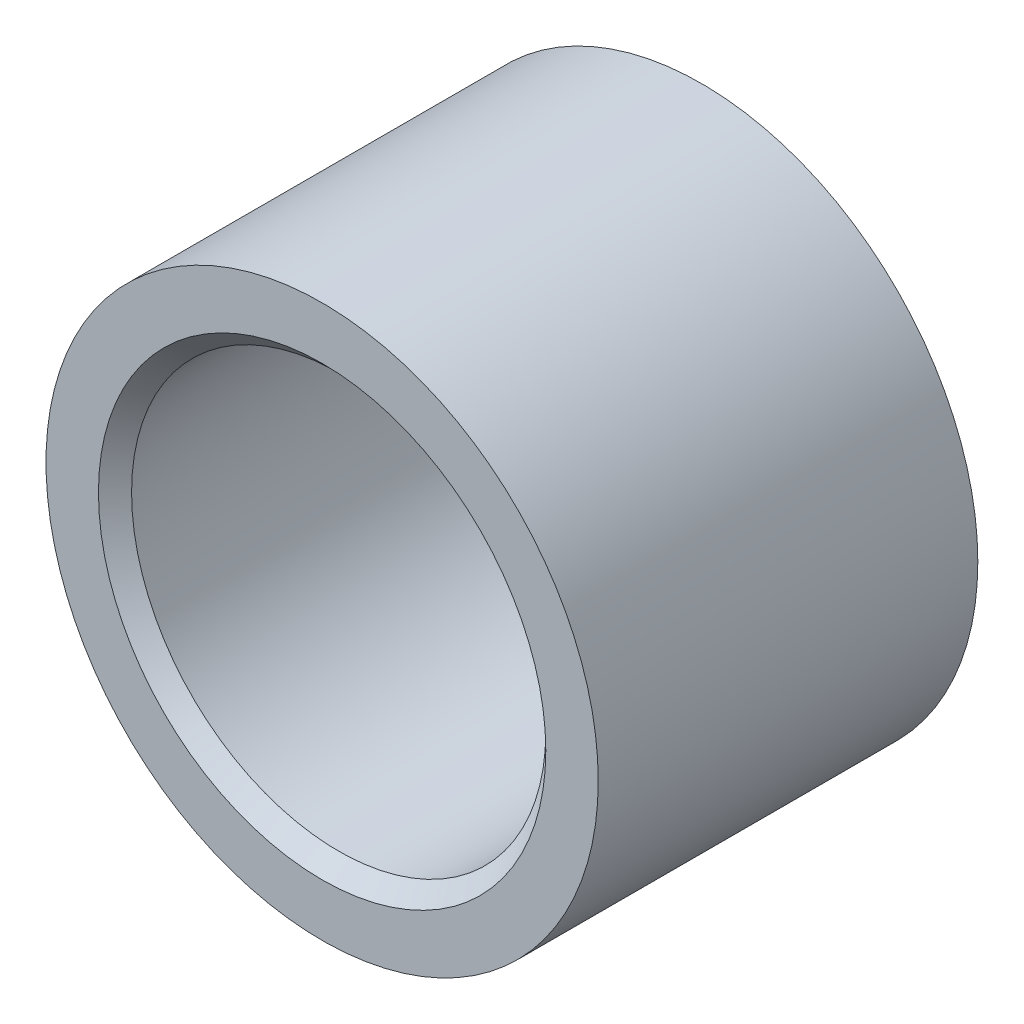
ISO-10303-21;
HEADER;
FILE_DESCRIPTION(('STEP AP214'),'2;1');
FILE_NAME('part.step','',(''),(''),'','','');
FILE_SCHEMA(('AUTOMOTIVE_DESIGN { 1 0 10303 214 1 1 1 1 }'));
ENDSEC;
DATA;
#1=APPLICATION_CONTEXT('core data for automotive mechanical design processes');
#2=APPLICATION_PROTOCOL_DEFINITION('international standard','automotive_design',2000,#1);
#3=PRODUCT_CONTEXT('',#1,'mechanical');
#4=PRODUCT('Part','Part','',(#3));
#5=PRODUCT_RELATED_PRODUCT_CATEGORY('part','',(#4));
#6=PRODUCT_DEFINITION_FORMATION('','',#4);
#7=PRODUCT_DEFINITION_CONTEXT('part definition',#1,'design');
#8=PRODUCT_DEFINITION('design','',#6,#7);
#9=PRODUCT_DEFINITION_SHAPE('','',#8);
#10=(LENGTH_UNIT() NAMED_UNIT(*) SI_UNIT(.MILLI.,.METRE.));
#11=(NAMED_UNIT(*) PLANE_ANGLE_UNIT() SI_UNIT($,.RADIAN.));
#12=(NAMED_UNIT(*) SI_UNIT($,.STERADIAN.) SOLID_ANGLE_UNIT());
#13=UNCERTAINTY_MEASURE_WITH_UNIT(LENGTH_MEASURE(1.E-05),#10,'distance_accuracy_value','');
#14=(GEOMETRIC_REPRESENTATION_CONTEXT(3) GLOBAL_UNCERTAINTY_ASSIGNED_CONTEXT((#13)) GLOBAL_UNIT_ASSIGNED_CONTEXT((#10,
#11,#12)) REPRESENTATION_CONTEXT('',''));
#15=CARTESIAN_POINT('',(0.,0.,0.));
#16=DIRECTION('',(0.,0.,1.));
#17=DIRECTION('',(1.,0.,0.));
#18=AXIS2_PLACEMENT_3D('',#15,#16,#17);
#19=CARTESIAN_POINT('',(0.,0.,31.775));
#20=DIRECTION('',(0.,0.,1.));
#21=DIRECTION('',(1.,0.,0.));
#22=AXIS2_PLACEMENT_3D('',#19,#20,#21);
#23=CYLINDRICAL_SURFACE('',#22,25.40635);
#24=CARTESIAN_POINT('',(0.,0.,0.));
#25=DIRECTION('',(0.,0.,1.));
#26=DIRECTION('',(1.,0.,0.));
#27=AXIS2_PLACEMENT_3D('',#24,#25,#26);
#28=CIRCLE('',#27,25.40635);
#29=CARTESIAN_POINT('',(25.40635,0.,0.));
#30=VERTEX_POINT('',#29);
#31=EDGE_CURVE('E32',#30,#30,#28,.T.);
#32=ORIENTED_EDGE('',*,*,#31,.F.);
#33=EDGE_LOOP('',(#32));
#34=FACE_BOUND('',#33,.T.);
#35=CARTESIAN_POINT('',(0.,0.,-34.925));
#36=DIRECTION('',(0.,0.,1.));
#37=DIRECTION('',(1.,0.,0.));
#38=AXIS2_PLACEMENT_3D('',#35,#36,#37);
#39=CIRCLE('',#38,25.40635);
#40=CARTESIAN_POINT('',(25.40635,0.,-34.925));
#41=VERTEX_POINT('',#40);
#42=EDGE_CURVE('E35',#41,#41,#39,.T.);
#43=ORIENTED_EDGE('',*,*,#42,.T.);
#44=EDGE_LOOP('',(#43));
#45=FACE_BOUND('',#44,.T.);
#46=ADVANCED_FACE('F13',(#34,#45),#23,.T.);
#47=CARTESIAN_POINT('',(25.40635,0.,0.));
#48=DIRECTION('',(0.,0.,-1.));
#49=DIRECTION('',(-1.,0.,0.));
#50=AXIS2_PLACEMENT_3D('',#47,#48,#49);
#51=PLANE('',#50);
#52=CARTESIAN_POINT('',(0.,0.,0.));
#53=DIRECTION('',(0.,0.,-1.));
#54=DIRECTION('',(-1.,0.,0.));
#55=AXIS2_PLACEMENT_3D('',#52,#53,#54);
#56=CIRCLE('',#55,20.58035);
#57=CARTESIAN_POINT('',(-20.58035,0.,0.));
#58=VERTEX_POINT('',#57);
#59=EDGE_CURVE('E9',#58,#58,#56,.T.);
#60=ORIENTED_EDGE('',*,*,#59,.T.);
#61=EDGE_LOOP('',(#60));
#62=FACE_BOUND('',#61,.T.);
#63=ORIENTED_EDGE('',*,*,#31,.T.);
#64=EDGE_LOOP('',(#63));
#65=FACE_BOUND('',#64,.T.);
#66=ADVANCED_FACE('F55',(#62,#65),#51,.F.);
#67=CARTESIAN_POINT('',(0.,0.,31.775));
#68=DIRECTION('',(0.,0.,1.));
#69=DIRECTION('',(1.,0.,0.));
#70=AXIS2_PLACEMENT_3D('',#67,#68,#69);
#71=CYLINDRICAL_SURFACE('',#70,19.05635);
#72=CARTESIAN_POINT('',(0.,0.,-33.401));
#73=DIRECTION('',(0.,0.,1.));
#74=DIRECTION('',(1.,0.,0.));
#75=AXIS2_PLACEMENT_3D('',#72,#73,#74);
#76=CIRCLE('',#75,19.05635);
#77=CARTESIAN_POINT('',(19.05635,0.,-33.401));
#78=VERTEX_POINT('',#77);
#79=EDGE_CURVE('E19',#78,#78,#76,.F.);
#80=ORIENTED_EDGE('',*,*,#79,.T.);
#81=EDGE_LOOP('',(#80));
#82=FACE_BOUND('',#81,.T.);
#83=CARTESIAN_POINT('',(0.,0.,-1.524));
#84=DIRECTION('',(0.,0.,-1.));
#85=DIRECTION('',(-1.,0.,0.));
#86=AXIS2_PLACEMENT_3D('',#83,#84,#85);
#87=CIRCLE('',#86,19.05635);
#88=CARTESIAN_POINT('',(-19.05635,0.,-1.524));
#89=VERTEX_POINT('',#88);
#90=EDGE_CURVE('E23',#89,#89,#87,.F.);
#91=ORIENTED_EDGE('',*,*,#90,.T.);
#92=EDGE_LOOP('',(#91));
#93=FACE_BOUND('',#92,.T.);
#94=ADVANCED_FACE('F43',(#82,#93),#71,.F.);
#95=CARTESIAN_POINT('',(19.05635,0.,-34.925));
#96=DIRECTION('',(0.,0.,1.));
#97=DIRECTION('',(1.,0.,0.));
#98=AXIS2_PLACEMENT_3D('',#95,#96,#97);
#99=PLANE('',#98);
#100=CARTESIAN_POINT('',(0.,0.,-34.925));
#101=DIRECTION('',(0.,0.,1.));
#102=DIRECTION('',(1.,0.,0.));
#103=AXIS2_PLACEMENT_3D('',#100,#101,#102);
#104=CIRCLE('',#103,20.58035);
#105=CARTESIAN_POINT('',(20.58035,0.,-34.925));
#106=VERTEX_POINT('',#105);
#107=EDGE_CURVE('E27',#106,#106,#104,.T.);
#108=ORIENTED_EDGE('',*,*,#107,.T.);
#109=EDGE_LOOP('',(#108));
#110=FACE_BOUND('',#109,.T.);
#111=ORIENTED_EDGE('',*,*,#42,.F.);
#112=EDGE_LOOP('',(#111));
#113=FACE_BOUND('',#112,.T.);
#114=ADVANCED_FACE('F40',(#110,#113),#99,.F.);
#115=CARTESIAN_POINT('',(0.,0.,-34.925));
#116=DIRECTION('',(0.,0.,-1.));
#117=DIRECTION('',(-1.,0.,0.));
#118=AXIS2_PLACEMENT_3D('',#115,#116,#117);
#119=CONICAL_SURFACE('',#118,20.58035,0.785398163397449);
#120=ORIENTED_EDGE('',*,*,#79,.F.);
#121=EDGE_LOOP('',(#120));
#122=FACE_BOUND('',#121,.T.);
#123=ORIENTED_EDGE('',*,*,#107,.F.);
#124=EDGE_LOOP('',(#123));
#125=FACE_BOUND('',#124,.T.);
#126=ADVANCED_FACE('F42',(#122,#125),#119,.F.);
#127=CARTESIAN_POINT('',(0.,0.,-1.524));
#128=DIRECTION('',(0.,0.,1.));
#129=DIRECTION('',(1.,0.,0.));
#130=AXIS2_PLACEMENT_3D('',#127,#128,#129);
#131=CONICAL_SURFACE('',#130,19.05635,0.785398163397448);
#132=ORIENTED_EDGE('',*,*,#59,.F.);
#133=EDGE_LOOP('',(#132));
#134=FACE_BOUND('',#133,.T.);
#135=ORIENTED_EDGE('',*,*,#90,.F.);
#136=EDGE_LOOP('',(#135));
#137=FACE_BOUND('',#136,.T.);
#138=ADVANCED_FACE('F52',(#134,#137),#131,.F.);
#139=CLOSED_SHELL('',(#46,#66,#94,#114,#126,#138));
#140=MANIFOLD_SOLID_BREP('B1',#139);
#141=ADVANCED_BREP_SHAPE_REPRESENTATION('',(#18,#140),#14);
#142=SHAPE_DEFINITION_REPRESENTATION(#9,#141);
ENDSEC;
END-ISO-10303-21;
